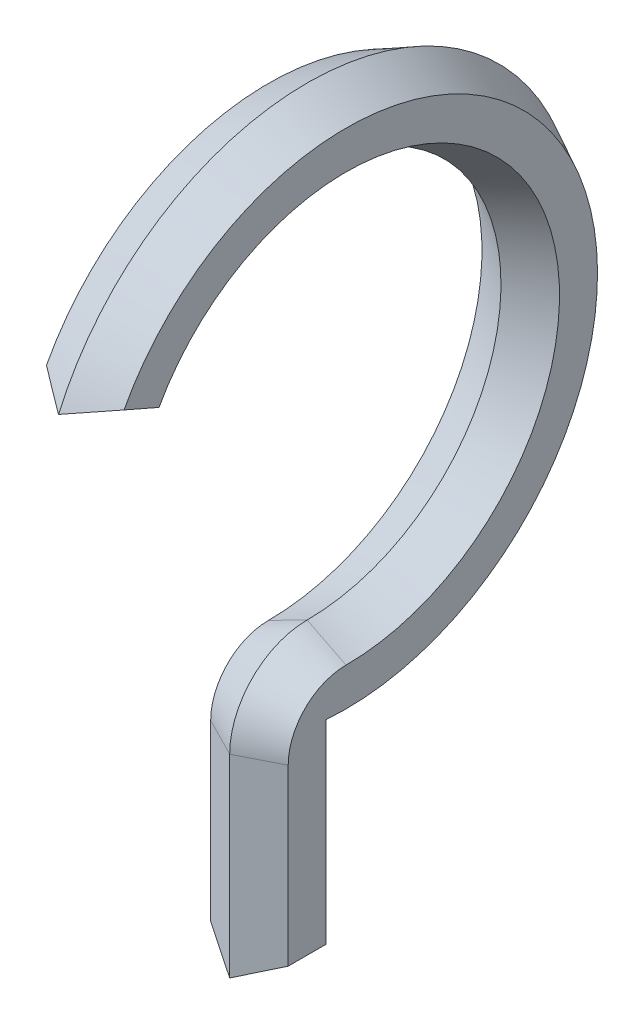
from build123d import *

# Parameters (mm, degrees)
EXTRUDE_THIN1_DEPTH           = 5
EXTRUDE_THIN1_DRAFT           = 27
EXTRUDE_THIN1_OTHER_WAY_DEPTH = 5
EXTRUDE_THIN1_OTHER_WAY_DRAFT = -27


with BuildPart() as part:
    # Sketch1 → Extrude-Thin1 (with draft: the straight prism first)
    with BuildSketch(Plane(origin=(0, 0, 0), x_dir=(0, 0, -1), z_dir=(1, 0, 0))):
        with BuildLine():
            Line((0, 0), (10, 0))
            Line((10, 0), (10, 25))
            ThreePointArc((10, 25), (39.283100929, 79.170289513), (-22.078029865, 74))
            Line((-22.078029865, 74), (-12.912878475, 70))
            ThreePointArc((-12.912878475, 70), (30.916500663, 73.693063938), (10, 35))
            ThreePointArc((10, 35), (2.928932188, 32.071067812), (0, 25))
            Line((0, 25), (0, 0))
        make_face()
    extrude(amount=EXTRUDE_THIN1_DEPTH)
    # Extrude-Thin1: the draft: its side faces are tilted about the plane it starts from
    extrude_thin1_sides = [part.faces().sort_by_distance(p)[0] for p in [
        (2.5, 12.5, 0),
        (2.5, 0, -5),
        (2.5, 12.5, -10),
        (2.5, 79.170289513, -39.283100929),
        (2.5, 72, 17.49545417),
        (2.5, 73.693063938, -30.916500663),
        (2.5, 32.071067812, -2.928932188),
    ]]
    draft(extrude_thin1_sides, Plane(origin=(0, 0, 0), x_dir=(0, 0, -1), z_dir=(1, 0, 0)), EXTRUDE_THIN1_DRAFT)


with BuildPart() as extrude_thin1_other_way_tool:
    # Sketch1 → Extrude-Thin1 other way (with draft: the straight prism first)
    with BuildSketch(Plane(origin=(0, 0, 0), x_dir=(0, 0, -1), z_dir=(1, 0, 0))):
        with BuildLine():
            Line((0, 0), (10, 0))
            Line((10, 0), (10, 25))
            ThreePointArc((10, 25), (39.283100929, 79.170289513), (-22.078029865, 74))
            Line((-22.078029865, 74), (-12.912878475, 70))
            ThreePointArc((-12.912878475, 70), (30.916500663, 73.693063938), (10, 35))
            ThreePointArc((10, 35), (2.928932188, 32.071067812), (0, 25))
            Line((0, 25), (0, 0))
        make_face()
    extrude(amount=-EXTRUDE_THIN1_OTHER_WAY_DEPTH)
    # Extrude-Thin1 other way: the draft: its side faces are tilted about the plane it starts from
    extrude_thin1_other_way_sides = [extrude_thin1_other_way_tool.faces().sort_by_distance(p)[0] for p in [
        (-2.5, 12.5, 0),
        (-2.5, 0, -5),
        (-2.5, 12.5, -10),
        (-2.5, 79.170289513, -39.283100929),
        (-2.5, 72, 17.49545417),
        (-2.5, 73.693063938, -30.916500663),
        (-2.5, 32.071067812, -2.928932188),
    ]]
    draft(extrude_thin1_other_way_sides, Plane(origin=(0, 0, 0), x_dir=(0, 0, -1), z_dir=(1, 0, 0)), EXTRUDE_THIN1_OTHER_WAY_DRAFT)


with BuildPart() as part_1:
    add(part.part)

    # Extrude-Thin1 other way: add extrude_thin1_other_way_tool
    add(extrude_thin1_other_way_tool.part)


solid = part_1.part
